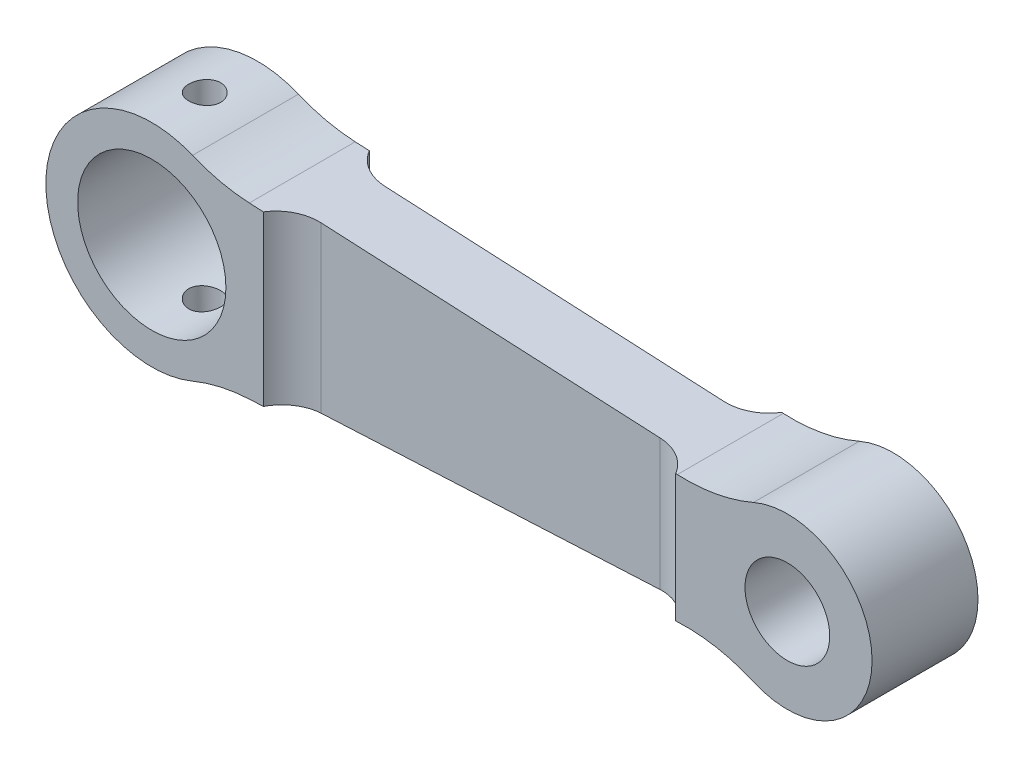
from build123d import *

# Parameters (mm, degrees)
ESQUISSE1_R             = 2
ESQUISSE1_R_2           = 3.5
BASE_EXTRUSION_DEPTH    = 2.5
ESQUISSE2_R             = 0.75
ENL_V_MAT_EXTRU_1_DEPTH = 10


with BuildPart() as part:
    # Esquisse1 → Base-Extrusion (new, symmetric)
    with BuildSketch(Plane.XY):
        with BuildLine():
            Line((4.604526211, -4.009780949), (24.808694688, -3.009780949))
            ThreePointArc((24.808694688, -3.009780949), (26.64302969, -3.130458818), (28.401389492, -3.666666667))
            ThreePointArc((28.401389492, -3.666666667), (34, 0), (28.401389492, 3.666666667))
            ThreePointArc((28.401389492, 3.666666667), (26.64302969, 3.130458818), (24.808694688, 3.009780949))
            Line((24.808694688, 3.009780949), (4.604526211, 4.009780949))
            ThreePointArc((4.604526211, 4.009780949), (3.237594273, 4.196543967), (1.923076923, 4.615384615))
            ThreePointArc((1.923076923, 4.615384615), (-5, 0), (1.923076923, -4.615384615))
            ThreePointArc((1.923076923, -4.615384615), (3.237594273, -4.196543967), (4.604526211, -4.009780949))
        make_face()
        with Locations((30, 0)):
            Circle(ESQUISSE1_R, mode=Mode.SUBTRACT)
        Circle(ESQUISSE1_R_2, mode=Mode.SUBTRACT)
    extrude(amount=BASE_EXTRUSION_DEPTH, both=True)

    # Esquisse2 → Enl_v. mat.-Extru.1 (cut, symmetric)
    with BuildSketch(Plane(origin=(0, 0, 0), x_dir=(1, 0, 0), z_dir=(0, 1, 0))):
        with Locations(Location((0, 0, 0), (0, 0, 270))):
            Circle(ESQUISSE2_R)
        with BuildLine():
            Line((5, 6.563022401), (25, 6.563022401))
            Line((25, 6.563022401), (25, 3.5))
            ThreePointArc((25, 3.5), (24.414213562, 2.085786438), (23, 1.5))
            Line((23, 1.5), (7, 1.5))
            ThreePointArc((7, 1.5), (5.585786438, 2.085786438), (5, 3.5))
            Line((5, 3.5), (5, 6.563022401))
        make_face()
        with BuildLine():
            Line((5, -5.954530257), (25, -5.954530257))
            Line((25, -5.954530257), (25, -3.5))
            ThreePointArc((25, -3.5), (24.414213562, -2.085786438), (23, -1.5))
            Line((23, -1.5), (7, -1.5))
            ThreePointArc((7, -1.5), (5.585786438, -2.085786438), (5, -3.5))
            Line((5, -3.5), (5, -5.954530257))
        make_face()
    extrude(amount=ENL_V_MAT_EXTRU_1_DEPTH, both=True, mode=Mode.SUBTRACT)


solid = part.part
